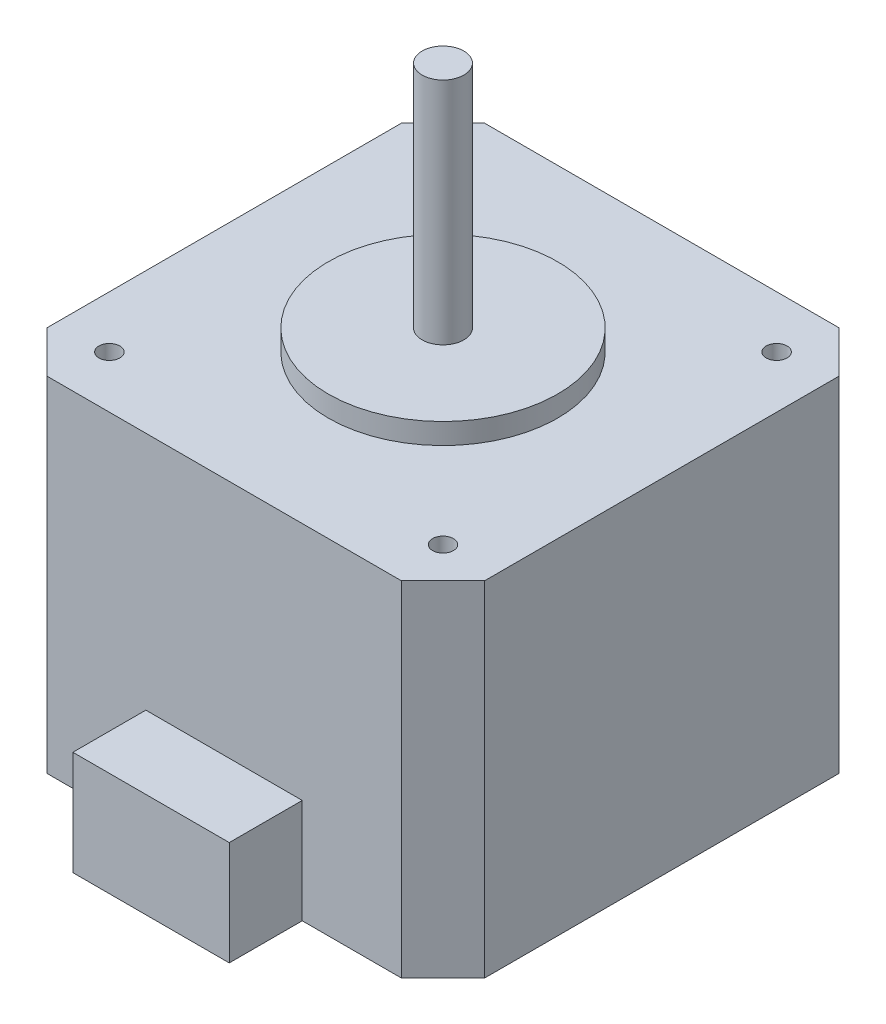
ISO-10303-21;
HEADER;
FILE_DESCRIPTION(('STEP AP214'),'2;1');
FILE_NAME('part.step','',(''),(''),'','','');
FILE_SCHEMA(('AUTOMOTIVE_DESIGN { 1 0 10303 214 1 1 1 1 }'));
ENDSEC;
DATA;
#1=APPLICATION_CONTEXT('core data for automotive mechanical design processes');
#2=APPLICATION_PROTOCOL_DEFINITION('international standard','automotive_design',2000,#1);
#3=PRODUCT_CONTEXT('',#1,'mechanical');
#4=PRODUCT('Part','Part','',(#3));
#5=PRODUCT_RELATED_PRODUCT_CATEGORY('part','',(#4));
#6=PRODUCT_DEFINITION_FORMATION('','',#4);
#7=PRODUCT_DEFINITION_CONTEXT('part definition',#1,'design');
#8=PRODUCT_DEFINITION('design','',#6,#7);
#9=PRODUCT_DEFINITION_SHAPE('','',#8);
#10=(LENGTH_UNIT() NAMED_UNIT(*) SI_UNIT(.MILLI.,.METRE.));
#11=(NAMED_UNIT(*) PLANE_ANGLE_UNIT() SI_UNIT($,.RADIAN.));
#12=(NAMED_UNIT(*) SI_UNIT($,.STERADIAN.) SOLID_ANGLE_UNIT());
#13=UNCERTAINTY_MEASURE_WITH_UNIT(LENGTH_MEASURE(1.E-05),#10,'distance_accuracy_value','');
#14=(GEOMETRIC_REPRESENTATION_CONTEXT(3) GLOBAL_UNCERTAINTY_ASSIGNED_CONTEXT((#13)) GLOBAL_UNIT_ASSIGNED_CONTEXT((#10,
#11,#12)) REPRESENTATION_CONTEXT('',''));
#15=CARTESIAN_POINT('',(0.,0.,0.));
#16=DIRECTION('',(0.,0.,1.));
#17=DIRECTION('',(1.,0.,0.));
#18=AXIS2_PLACEMENT_3D('',#15,#16,#17);
#19=CARTESIAN_POINT('',(0.,33.,42.));
#20=DIRECTION('',(0.,0.,-1.));
#21=DIRECTION('',(-1.,0.,0.));
#22=AXIS2_PLACEMENT_3D('',#19,#20,#21);
#23=PLANE('',#22);
#24=DIRECTION('',(1.,0.,0.));
#25=VECTOR('',#24,1.);
#26=CARTESIAN_POINT('',(0.,0.,42.));
#27=LINE('',#26,#25);
#28=CARTESIAN_POINT('',(28.5,0.,42.));
#29=VERTEX_POINT('',#28);
#30=CARTESIAN_POINT('',(38.,0.,42.));
#31=VERTEX_POINT('',#30);
#32=EDGE_CURVE('E222',#29,#31,#27,.T.);
#33=ORIENTED_EDGE('',*,*,#32,.T.);
#34=DIRECTION('',(0.,1.,0.));
#35=VECTOR('',#34,1.);
#36=CARTESIAN_POINT('',(38.,33.,42.));
#37=LINE('',#36,#35);
#38=CARTESIAN_POINT('',(38.,33.,42.));
#39=VERTEX_POINT('',#38);
#40=EDGE_CURVE('E244',#31,#39,#37,.T.);
#41=ORIENTED_EDGE('',*,*,#40,.T.);
#42=DIRECTION('',(1.,0.,0.));
#43=VECTOR('',#42,1.);
#44=CARTESIAN_POINT('',(0.,33.,42.));
#45=LINE('',#44,#43);
#46=CARTESIAN_POINT('',(4.,33.,42.));
#47=VERTEX_POINT('',#46);
#48=EDGE_CURVE('E213',#47,#39,#45,.T.);
#49=ORIENTED_EDGE('',*,*,#48,.F.);
#50=DIRECTION('',(0.,-1.,0.));
#51=VECTOR('',#50,1.);
#52=CARTESIAN_POINT('',(4.,33.,42.));
#53=LINE('',#52,#51);
#54=CARTESIAN_POINT('',(4.,0.,42.));
#55=VERTEX_POINT('',#54);
#56=EDGE_CURVE('E241',#47,#55,#53,.T.);
#57=ORIENTED_EDGE('',*,*,#56,.T.);
#58=CARTESIAN_POINT('',(13.5,0.,42.));
#59=VERTEX_POINT('',#58);
#60=EDGE_CURVE('E223',#55,#59,#27,.T.);
#61=ORIENTED_EDGE('',*,*,#60,.T.);
#62=DIRECTION('',(0.,-1.,0.));
#63=VECTOR('',#62,1.);
#64=CARTESIAN_POINT('',(13.5,0.,42.));
#65=LINE('',#64,#63);
#66=CARTESIAN_POINT('',(13.5,10.,42.));
#67=VERTEX_POINT('',#66);
#68=EDGE_CURVE('E165',#67,#59,#65,.T.);
#69=ORIENTED_EDGE('',*,*,#68,.F.);
#70=DIRECTION('',(-1.,0.,0.));
#71=VECTOR('',#70,1.);
#72=CARTESIAN_POINT('',(13.5,10.,42.));
#73=LINE('',#72,#71);
#74=CARTESIAN_POINT('',(28.5,10.,42.));
#75=VERTEX_POINT('',#74);
#76=EDGE_CURVE('E170',#75,#67,#73,.T.);
#77=ORIENTED_EDGE('',*,*,#76,.F.);
#78=DIRECTION('',(0.,1.,0.));
#79=VECTOR('',#78,1.);
#80=CARTESIAN_POINT('',(28.5,0.,42.));
#81=LINE('',#80,#79);
#82=EDGE_CURVE('E179',#29,#75,#81,.T.);
#83=ORIENTED_EDGE('',*,*,#82,.F.);
#84=EDGE_LOOP('',(#33,#41,#49,#57,#61,#69,#77,#83));
#85=FACE_BOUND('',#84,.T.);
#86=ADVANCED_FACE('F33',(#85),#23,.F.);
#87=CARTESIAN_POINT('',(0.,33.,0.));
#88=DIRECTION('',(1.,0.,0.));
#89=DIRECTION('',(0.,0.,-1.));
#90=AXIS2_PLACEMENT_3D('',#87,#88,#89);
#91=PLANE('',#90);
#92=DIRECTION('',(0.,0.,1.));
#93=VECTOR('',#92,1.);
#94=CARTESIAN_POINT('',(0.,0.,0.));
#95=LINE('',#94,#93);
#96=CARTESIAN_POINT('',(0.,0.,4.));
#97=VERTEX_POINT('',#96);
#98=CARTESIAN_POINT('',(0.,0.,38.));
#99=VERTEX_POINT('',#98);
#100=EDGE_CURVE('E206',#97,#99,#95,.T.);
#101=ORIENTED_EDGE('',*,*,#100,.T.);
#102=DIRECTION('',(0.,1.,0.));
#103=VECTOR('',#102,1.);
#104=CARTESIAN_POINT('',(0.,33.,38.));
#105=LINE('',#104,#103);
#106=CARTESIAN_POINT('',(0.,33.,38.));
#107=VERTEX_POINT('',#106);
#108=EDGE_CURVE('E256',#99,#107,#105,.T.);
#109=ORIENTED_EDGE('',*,*,#108,.T.);
#110=DIRECTION('',(0.,0.,1.));
#111=VECTOR('',#110,1.);
#112=CARTESIAN_POINT('',(0.,33.,0.));
#113=LINE('',#112,#111);
#114=CARTESIAN_POINT('',(0.,33.,4.));
#115=VERTEX_POINT('',#114);
#116=EDGE_CURVE('E210',#115,#107,#113,.T.);
#117=ORIENTED_EDGE('',*,*,#116,.F.);
#118=DIRECTION('',(0.,-1.,0.));
#119=VECTOR('',#118,1.);
#120=CARTESIAN_POINT('',(0.,33.,4.));
#121=LINE('',#120,#119);
#122=EDGE_CURVE('E253',#115,#97,#121,.T.);
#123=ORIENTED_EDGE('',*,*,#122,.T.);
#124=EDGE_LOOP('',(#101,#109,#117,#123));
#125=FACE_BOUND('',#124,.T.);
#126=ADVANCED_FACE('F272',(#125),#91,.F.);
#127=CARTESIAN_POINT('',(42.,33.,0.));
#128=DIRECTION('',(-1.,0.,0.));
#129=DIRECTION('',(0.,0.,1.));
#130=AXIS2_PLACEMENT_3D('',#127,#128,#129);
#131=PLANE('',#130);
#132=DIRECTION('',(0.,0.,-1.));
#133=VECTOR('',#132,1.);
#134=CARTESIAN_POINT('',(42.,33.,0.));
#135=LINE('',#134,#133);
#136=CARTESIAN_POINT('',(42.,33.,38.));
#137=VERTEX_POINT('',#136);
#138=CARTESIAN_POINT('',(42.,33.,4.00000000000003));
#139=VERTEX_POINT('',#138);
#140=EDGE_CURVE('E217',#137,#139,#135,.T.);
#141=ORIENTED_EDGE('',*,*,#140,.F.);
#142=DIRECTION('',(0.,-1.,0.));
#143=VECTOR('',#142,1.);
#144=CARTESIAN_POINT('',(42.,33.,38.));
#145=LINE('',#144,#143);
#146=CARTESIAN_POINT('',(42.,0.,38.));
#147=VERTEX_POINT('',#146);
#148=EDGE_CURVE('E230',#137,#147,#145,.T.);
#149=ORIENTED_EDGE('',*,*,#148,.T.);
#150=DIRECTION('',(0.,0.,-1.));
#151=VECTOR('',#150,1.);
#152=CARTESIAN_POINT('',(42.,0.,0.));
#153=LINE('',#152,#151);
#154=CARTESIAN_POINT('',(42.,0.,4.00000000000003));
#155=VERTEX_POINT('',#154);
#156=EDGE_CURVE('E225',#147,#155,#153,.T.);
#157=ORIENTED_EDGE('',*,*,#156,.T.);
#158=DIRECTION('',(0.,1.,0.));
#159=VECTOR('',#158,1.);
#160=CARTESIAN_POINT('',(42.,33.,4.00000000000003));
#161=LINE('',#160,#159);
#162=EDGE_CURVE('E202',#155,#139,#161,.T.);
#163=ORIENTED_EDGE('',*,*,#162,.T.);
#164=EDGE_LOOP('',(#141,#149,#157,#163));
#165=FACE_BOUND('',#164,.T.);
#166=ADVANCED_FACE('F304',(#165),#131,.F.);
#167=CARTESIAN_POINT('',(0.,33.,0.));
#168=DIRECTION('',(0.,0.,1.));
#169=DIRECTION('',(1.,0.,0.));
#170=AXIS2_PLACEMENT_3D('',#167,#168,#169);
#171=PLANE('',#170);
#172=DIRECTION('',(-1.,0.,0.));
#173=VECTOR('',#172,1.);
#174=CARTESIAN_POINT('',(0.,0.,0.));
#175=LINE('',#174,#173);
#176=CARTESIAN_POINT('',(38.,0.,0.));
#177=VERTEX_POINT('',#176);
#178=CARTESIAN_POINT('',(4.00000000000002,0.,0.));
#179=VERTEX_POINT('',#178);
#180=EDGE_CURVE('E214',#177,#179,#175,.T.);
#181=ORIENTED_EDGE('',*,*,#180,.T.);
#182=DIRECTION('',(0.,1.,0.));
#183=VECTOR('',#182,1.);
#184=CARTESIAN_POINT('',(4.00000000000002,33.,0.));
#185=LINE('',#184,#183);
#186=CARTESIAN_POINT('',(4.00000000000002,33.,0.));
#187=VERTEX_POINT('',#186);
#188=EDGE_CURVE('E11',#179,#187,#185,.T.);
#189=ORIENTED_EDGE('',*,*,#188,.T.);
#190=DIRECTION('',(-1.,0.,0.));
#191=VECTOR('',#190,1.);
#192=CARTESIAN_POINT('',(0.,33.,0.));
#193=LINE('',#192,#191);
#194=CARTESIAN_POINT('',(38.,33.,0.));
#195=VERTEX_POINT('',#194);
#196=EDGE_CURVE('E209',#195,#187,#193,.T.);
#197=ORIENTED_EDGE('',*,*,#196,.F.);
#198=DIRECTION('',(0.,-1.,0.));
#199=VECTOR('',#198,1.);
#200=CARTESIAN_POINT('',(38.,33.,0.));
#201=LINE('',#200,#199);
#202=EDGE_CURVE('E41',#195,#177,#201,.T.);
#203=ORIENTED_EDGE('',*,*,#202,.T.);
#204=EDGE_LOOP('',(#181,#189,#197,#203));
#205=FACE_BOUND('',#204,.T.);
#206=ADVANCED_FACE('F260',(#205),#171,.F.);
#207=CARTESIAN_POINT('',(0.,33.,0.));
#208=DIRECTION('',(0.,1.,0.));
#209=DIRECTION('',(0.,0.,1.));
#210=AXIS2_PLACEMENT_3D('',#207,#208,#209);
#211=PLANE('',#210);
#212=CARTESIAN_POINT('',(37.,33.,5.));
#213=DIRECTION('',(0.,1.,0.));
#214=DIRECTION('',(0.,0.,1.));
#215=AXIS2_PLACEMENT_3D('',#212,#213,#214);
#216=CIRCLE('',#215,0.999999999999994);
#217=CARTESIAN_POINT('',(37.,33.,5.99999999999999));
#218=VERTEX_POINT('',#217);
#219=EDGE_CURVE('E143',#218,#218,#216,.T.);
#220=ORIENTED_EDGE('',*,*,#219,.F.);
#221=EDGE_LOOP('',(#220));
#222=FACE_BOUND('',#221,.T.);
#223=CARTESIAN_POINT('',(37.,33.,37.));
#224=DIRECTION('',(0.,1.,0.));
#225=DIRECTION('',(0.,0.,1.));
#226=AXIS2_PLACEMENT_3D('',#223,#224,#225);
#227=CIRCLE('',#226,0.999999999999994);
#228=CARTESIAN_POINT('',(37.,33.,38.));
#229=VERTEX_POINT('',#228);
#230=EDGE_CURVE('E142',#229,#229,#227,.T.);
#231=ORIENTED_EDGE('',*,*,#230,.F.);
#232=EDGE_LOOP('',(#231));
#233=FACE_BOUND('',#232,.T.);
#234=CARTESIAN_POINT('',(5.00000000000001,33.,37.));
#235=DIRECTION('',(0.,1.,0.));
#236=DIRECTION('',(0.,0.,1.));
#237=AXIS2_PLACEMENT_3D('',#234,#235,#236);
#238=CIRCLE('',#237,0.999999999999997);
#239=CARTESIAN_POINT('',(5.00000000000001,33.,38.));
#240=VERTEX_POINT('',#239);
#241=EDGE_CURVE('E153',#240,#240,#238,.T.);
#242=ORIENTED_EDGE('',*,*,#241,.F.);
#243=EDGE_LOOP('',(#242));
#244=FACE_BOUND('',#243,.T.);
#245=CARTESIAN_POINT('',(5.,33.,5.));
#246=DIRECTION('',(0.,1.,0.));
#247=DIRECTION('',(0.,0.,1.));
#248=AXIS2_PLACEMENT_3D('',#245,#246,#247);
#249=CIRCLE('',#248,0.999999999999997);
#250=CARTESIAN_POINT('',(5.,33.,6.));
#251=VERTEX_POINT('',#250);
#252=EDGE_CURVE('E159',#251,#251,#249,.T.);
#253=ORIENTED_EDGE('',*,*,#252,.F.);
#254=EDGE_LOOP('',(#253));
#255=FACE_BOUND('',#254,.T.);
#256=CARTESIAN_POINT('',(21.,33.,21.));
#257=DIRECTION('',(0.,1.,0.));
#258=DIRECTION('',(0.,0.,1.));
#259=AXIS2_PLACEMENT_3D('',#256,#257,#258);
#260=CIRCLE('',#259,11.);
#261=CARTESIAN_POINT('',(21.,33.,32.));
#262=VERTEX_POINT('',#261);
#263=EDGE_CURVE('E203',#262,#262,#260,.T.);
#264=ORIENTED_EDGE('',*,*,#263,.F.);
#265=EDGE_LOOP('',(#264));
#266=FACE_BOUND('',#265,.T.);
#267=ORIENTED_EDGE('',*,*,#48,.T.);
#268=DIRECTION('',(-0.707106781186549,0.,0.707106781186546));
#269=VECTOR('',#268,1.);
#270=CARTESIAN_POINT('',(39.9999999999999,33.,40.0000000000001));
#271=LINE('',#270,#269);
#272=EDGE_CURVE('E251',#39,#137,#271,.F.);
#273=ORIENTED_EDGE('',*,*,#272,.T.);
#274=ORIENTED_EDGE('',*,*,#140,.T.);
#275=DIRECTION('',(0.707106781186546,0.,0.707106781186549));
#276=VECTOR('',#275,1.);
#277=CARTESIAN_POINT('',(19.0000000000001,33.,-19.));
#278=LINE('',#277,#276);
#279=EDGE_CURVE('E53',#139,#195,#278,.F.);
#280=ORIENTED_EDGE('',*,*,#279,.T.);
#281=ORIENTED_EDGE('',*,*,#196,.T.);
#282=DIRECTION('',(0.707106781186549,0.,-0.707106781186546));
#283=VECTOR('',#282,1.);
#284=CARTESIAN_POINT('',(2.,33.,2.00000000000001));
#285=LINE('',#284,#283);
#286=EDGE_CURVE('E247',#187,#115,#285,.F.);
#287=ORIENTED_EDGE('',*,*,#286,.T.);
#288=ORIENTED_EDGE('',*,*,#116,.T.);
#289=DIRECTION('',(-0.707106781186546,0.,-0.707106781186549));
#290=VECTOR('',#289,1.);
#291=CARTESIAN_POINT('',(-19.,33.,18.9999999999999));
#292=LINE('',#291,#290);
#293=EDGE_CURVE('E249',#107,#47,#292,.F.);
#294=ORIENTED_EDGE('',*,*,#293,.T.);
#295=EDGE_LOOP('',(#267,#273,#274,#280,#281,#287,#288,#294));
#296=FACE_BOUND('',#295,.T.);
#297=ADVANCED_FACE('F275',(#222,#233,#244,#255,#266,#296),#211,.T.);
#298=CARTESIAN_POINT('',(0.,0.,0.));
#299=DIRECTION('',(0.,1.,0.));
#300=DIRECTION('',(0.,0.,1.));
#301=AXIS2_PLACEMENT_3D('',#298,#299,#300);
#302=PLANE('',#301);
#303=ORIENTED_EDGE('',*,*,#156,.F.);
#304=DIRECTION('',(0.707106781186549,0.,-0.707106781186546));
#305=VECTOR('',#304,1.);
#306=CARTESIAN_POINT('',(42.,0.,38.));
#307=LINE('',#306,#305);
#308=EDGE_CURVE('E239',#147,#31,#307,.F.);
#309=ORIENTED_EDGE('',*,*,#308,.T.);
#310=ORIENTED_EDGE('',*,*,#32,.F.);
#311=DIRECTION('',(0.,0.,-1.));
#312=VECTOR('',#311,1.);
#313=CARTESIAN_POINT('',(28.5,0.,49.));
#314=LINE('',#313,#312);
#315=CARTESIAN_POINT('',(28.5,0.,49.));
#316=VERTEX_POINT('',#315);
#317=EDGE_CURVE('E189',#316,#29,#314,.T.);
#318=ORIENTED_EDGE('',*,*,#317,.F.);
#319=DIRECTION('',(1.,0.,0.));
#320=VECTOR('',#319,1.);
#321=CARTESIAN_POINT('',(13.5,0.,49.));
#322=LINE('',#321,#320);
#323=CARTESIAN_POINT('',(13.5,0.,49.));
#324=VERTEX_POINT('',#323);
#325=EDGE_CURVE('E169',#324,#316,#322,.T.);
#326=ORIENTED_EDGE('',*,*,#325,.F.);
#327=DIRECTION('',(0.,0.,-1.));
#328=VECTOR('',#327,1.);
#329=CARTESIAN_POINT('',(13.5,0.,49.));
#330=LINE('',#329,#328);
#331=EDGE_CURVE('E192',#324,#59,#330,.T.);
#332=ORIENTED_EDGE('',*,*,#331,.T.);
#333=ORIENTED_EDGE('',*,*,#60,.F.);
#334=DIRECTION('',(0.707106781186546,0.,0.707106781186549));
#335=VECTOR('',#334,1.);
#336=CARTESIAN_POINT('',(4.,0.,42.));
#337=LINE('',#336,#335);
#338=EDGE_CURVE('E237',#55,#99,#337,.F.);
#339=ORIENTED_EDGE('',*,*,#338,.T.);
#340=ORIENTED_EDGE('',*,*,#100,.F.);
#341=DIRECTION('',(-0.707106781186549,0.,0.707106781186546));
#342=VECTOR('',#341,1.);
#343=CARTESIAN_POINT('',(0.,0.,4.));
#344=LINE('',#343,#342);
#345=EDGE_CURVE('E235',#97,#179,#344,.F.);
#346=ORIENTED_EDGE('',*,*,#345,.T.);
#347=ORIENTED_EDGE('',*,*,#180,.F.);
#348=DIRECTION('',(-0.707106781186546,0.,-0.707106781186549));
#349=VECTOR('',#348,1.);
#350=CARTESIAN_POINT('',(38.,0.,0.));
#351=LINE('',#350,#349);
#352=EDGE_CURVE('E233',#177,#155,#351,.F.);
#353=ORIENTED_EDGE('',*,*,#352,.T.);
#354=EDGE_LOOP('',(#303,#309,#310,#318,#326,#332,#333,#339,#340,#346,#347,#353));
#355=FACE_BOUND('',#354,.T.);
#356=ADVANCED_FACE('F264',(#355),#302,.F.);
#357=CARTESIAN_POINT('',(21.,35.,21.));
#358=DIRECTION('',(0.,-1.,0.));
#359=DIRECTION('',(0.,0.,-1.));
#360=AXIS2_PLACEMENT_3D('',#357,#358,#359);
#361=CYLINDRICAL_SURFACE('',#360,11.);
#362=CARTESIAN_POINT('',(21.,35.,21.));
#363=DIRECTION('',(0.,1.,0.));
#364=DIRECTION('',(0.,0.,1.));
#365=AXIS2_PLACEMENT_3D('',#362,#363,#364);
#366=CIRCLE('',#365,11.);
#367=CARTESIAN_POINT('',(21.,35.,32.));
#368=VERTEX_POINT('',#367);
#369=EDGE_CURVE('E198',#368,#368,#366,.T.);
#370=ORIENTED_EDGE('',*,*,#369,.F.);
#371=EDGE_LOOP('',(#370));
#372=FACE_BOUND('',#371,.T.);
#373=ORIENTED_EDGE('',*,*,#263,.T.);
#374=EDGE_LOOP('',(#373));
#375=FACE_BOUND('',#374,.T.);
#376=ADVANCED_FACE('F448',(#372,#375),#361,.T.);
#377=CARTESIAN_POINT('',(21.,35.,21.));
#378=DIRECTION('',(0.,1.,0.));
#379=DIRECTION('',(0.,0.,1.));
#380=AXIS2_PLACEMENT_3D('',#377,#378,#379);
#381=PLANE('',#380);
#382=CARTESIAN_POINT('',(21.,35.,21.));
#383=DIRECTION('',(0.,1.,0.));
#384=DIRECTION('',(0.,0.,1.));
#385=AXIS2_PLACEMENT_3D('',#382,#383,#384);
#386=CIRCLE('',#385,2.);
#387=CARTESIAN_POINT('',(21.,35.,23.));
#388=VERTEX_POINT('',#387);
#389=EDGE_CURVE('E199',#388,#388,#386,.T.);
#390=ORIENTED_EDGE('',*,*,#389,.F.);
#391=EDGE_LOOP('',(#390));
#392=FACE_BOUND('',#391,.T.);
#393=ORIENTED_EDGE('',*,*,#369,.T.);
#394=EDGE_LOOP('',(#393));
#395=FACE_BOUND('',#394,.T.);
#396=ADVANCED_FACE('F475',(#392,#395),#381,.T.);
#397=CARTESIAN_POINT('',(21.,57.,21.));
#398=DIRECTION('',(0.,-1.,0.));
#399=DIRECTION('',(0.,0.,-1.));
#400=AXIS2_PLACEMENT_3D('',#397,#398,#399);
#401=CYLINDRICAL_SURFACE('',#400,2.);
#402=CARTESIAN_POINT('',(21.,57.,21.));
#403=DIRECTION('',(0.,1.,0.));
#404=DIRECTION('',(0.,0.,1.));
#405=AXIS2_PLACEMENT_3D('',#402,#403,#404);
#406=CIRCLE('',#405,2.);
#407=CARTESIAN_POINT('',(21.,57.,23.));
#408=VERTEX_POINT('',#407);
#409=EDGE_CURVE('E195',#408,#408,#406,.T.);
#410=ORIENTED_EDGE('',*,*,#409,.F.);
#411=EDGE_LOOP('',(#410));
#412=FACE_BOUND('',#411,.T.);
#413=ORIENTED_EDGE('',*,*,#389,.T.);
#414=EDGE_LOOP('',(#413));
#415=FACE_BOUND('',#414,.T.);
#416=ADVANCED_FACE('F466',(#412,#415),#401,.T.);
#417=CARTESIAN_POINT('',(21.,57.,21.));
#418=DIRECTION('',(0.,1.,0.));
#419=DIRECTION('',(0.,0.,1.));
#420=AXIS2_PLACEMENT_3D('',#417,#418,#419);
#421=PLANE('',#420);
#422=ORIENTED_EDGE('',*,*,#409,.T.);
#423=EDGE_LOOP('',(#422));
#424=FACE_BOUND('',#423,.T.);
#425=ADVANCED_FACE('F439',(#424),#421,.T.);
#426=CARTESIAN_POINT('',(13.5,0.,49.));
#427=DIRECTION('',(1.,0.,0.));
#428=DIRECTION('',(0.,0.,-1.));
#429=AXIS2_PLACEMENT_3D('',#426,#427,#428);
#430=PLANE('',#429);
#431=ORIENTED_EDGE('',*,*,#68,.T.);
#432=ORIENTED_EDGE('',*,*,#331,.F.);
#433=DIRECTION('',(0.,-1.,0.));
#434=VECTOR('',#433,1.);
#435=CARTESIAN_POINT('',(13.5,0.,49.));
#436=LINE('',#435,#434);
#437=CARTESIAN_POINT('',(13.5,10.,49.));
#438=VERTEX_POINT('',#437);
#439=EDGE_CURVE('E166',#438,#324,#436,.T.);
#440=ORIENTED_EDGE('',*,*,#439,.F.);
#441=DIRECTION('',(0.,0.,-1.));
#442=VECTOR('',#441,1.);
#443=CARTESIAN_POINT('',(13.5,10.,49.));
#444=LINE('',#443,#442);
#445=EDGE_CURVE('E176',#438,#67,#444,.T.);
#446=ORIENTED_EDGE('',*,*,#445,.T.);
#447=EDGE_LOOP('',(#431,#432,#440,#446));
#448=FACE_BOUND('',#447,.T.);
#449=ADVANCED_FACE('F287',(#448),#430,.F.);
#450=CARTESIAN_POINT('',(28.5,0.,49.));
#451=DIRECTION('',(-1.,0.,0.));
#452=DIRECTION('',(0.,0.,1.));
#453=AXIS2_PLACEMENT_3D('',#450,#451,#452);
#454=PLANE('',#453);
#455=ORIENTED_EDGE('',*,*,#82,.T.);
#456=DIRECTION('',(0.,0.,-1.));
#457=VECTOR('',#456,1.);
#458=CARTESIAN_POINT('',(28.5,10.,49.));
#459=LINE('',#458,#457);
#460=CARTESIAN_POINT('',(28.5,10.,49.));
#461=VERTEX_POINT('',#460);
#462=EDGE_CURVE('E186',#461,#75,#459,.T.);
#463=ORIENTED_EDGE('',*,*,#462,.F.);
#464=DIRECTION('',(0.,1.,0.));
#465=VECTOR('',#464,1.);
#466=CARTESIAN_POINT('',(28.5,0.,49.));
#467=LINE('',#466,#465);
#468=EDGE_CURVE('E172',#316,#461,#467,.T.);
#469=ORIENTED_EDGE('',*,*,#468,.F.);
#470=ORIENTED_EDGE('',*,*,#317,.T.);
#471=EDGE_LOOP('',(#455,#463,#469,#470));
#472=FACE_BOUND('',#471,.T.);
#473=ADVANCED_FACE('F295',(#472),#454,.F.);
#474=CARTESIAN_POINT('',(13.5,10.,49.));
#475=DIRECTION('',(0.,-1.,0.));
#476=DIRECTION('',(0.,0.,-1.));
#477=AXIS2_PLACEMENT_3D('',#474,#475,#476);
#478=PLANE('',#477);
#479=ORIENTED_EDGE('',*,*,#76,.T.);
#480=ORIENTED_EDGE('',*,*,#445,.F.);
#481=DIRECTION('',(-1.,0.,0.));
#482=VECTOR('',#481,1.);
#483=CARTESIAN_POINT('',(13.5,10.,49.));
#484=LINE('',#483,#482);
#485=EDGE_CURVE('E174',#461,#438,#484,.T.);
#486=ORIENTED_EDGE('',*,*,#485,.F.);
#487=ORIENTED_EDGE('',*,*,#462,.T.);
#488=EDGE_LOOP('',(#479,#480,#486,#487));
#489=FACE_BOUND('',#488,.T.);
#490=ADVANCED_FACE('F290',(#489),#478,.F.);
#491=CARTESIAN_POINT('',(0.,0.,49.));
#492=DIRECTION('',(0.,0.,-1.));
#493=DIRECTION('',(-1.,0.,0.));
#494=AXIS2_PLACEMENT_3D('',#491,#492,#493);
#495=PLANE('',#494);
#496=ORIENTED_EDGE('',*,*,#439,.T.);
#497=ORIENTED_EDGE('',*,*,#325,.T.);
#498=ORIENTED_EDGE('',*,*,#468,.T.);
#499=ORIENTED_EDGE('',*,*,#485,.T.);
#500=EDGE_LOOP('',(#496,#497,#498,#499));
#501=FACE_BOUND('',#500,.T.);
#502=ADVANCED_FACE('F408',(#501),#495,.F.);
#503=CARTESIAN_POINT('',(5.,25.,5.));
#504=DIRECTION('',(0.,1.,0.));
#505=DIRECTION('',(0.,0.,1.));
#506=AXIS2_PLACEMENT_3D('',#503,#504,#505);
#507=CONICAL_SURFACE('',#506,0.999999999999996,1.02974425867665);
#508=CARTESIAN_POINT('',(5.,24.3991393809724,5.));
#509=VERTEX_POINT('',#508);
#510=VERTEX_LOOP('',#509);
#511=FACE_BOUND('',#510,.T.);
#512=CARTESIAN_POINT('',(5.,25.,5.));
#513=DIRECTION('',(0.,1.,0.));
#514=DIRECTION('',(0.,0.,1.));
#515=AXIS2_PLACEMENT_3D('',#512,#513,#514);
#516=CIRCLE('',#515,0.999999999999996);
#517=CARTESIAN_POINT('',(5.,25.,6.));
#518=VERTEX_POINT('',#517);
#519=EDGE_CURVE('E162',#518,#518,#516,.T.);
#520=ORIENTED_EDGE('',*,*,#519,.T.);
#521=EDGE_LOOP('',(#520));
#522=FACE_BOUND('',#521,.T.);
#523=ADVANCED_FACE('F399',(#511,#522),#507,.F.);
#524=CARTESIAN_POINT('',(5.,33.,5.));
#525=DIRECTION('',(0.,1.,0.));
#526=DIRECTION('',(0.,0.,1.));
#527=AXIS2_PLACEMENT_3D('',#524,#525,#526);
#528=CYLINDRICAL_SURFACE('',#527,0.999999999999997);
#529=ORIENTED_EDGE('',*,*,#519,.F.);
#530=EDGE_LOOP('',(#529));
#531=FACE_BOUND('',#530,.T.);
#532=ORIENTED_EDGE('',*,*,#252,.T.);
#533=EDGE_LOOP('',(#532));
#534=FACE_BOUND('',#533,.T.);
#535=ADVANCED_FACE('F390',(#531,#534),#528,.F.);
#536=CARTESIAN_POINT('',(5.00000000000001,25.,37.));
#537=DIRECTION('',(0.,1.,0.));
#538=DIRECTION('',(0.,0.,1.));
#539=AXIS2_PLACEMENT_3D('',#536,#537,#538);
#540=CONICAL_SURFACE('',#539,0.999999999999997,1.02974425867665);
#541=CARTESIAN_POINT('',(5.,24.3991393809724,37.));
#542=VERTEX_POINT('',#541);
#543=VERTEX_LOOP('',#542);
#544=FACE_BOUND('',#543,.T.);
#545=CARTESIAN_POINT('',(5.00000000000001,25.,37.));
#546=DIRECTION('',(0.,1.,0.));
#547=DIRECTION('',(0.,0.,1.));
#548=AXIS2_PLACEMENT_3D('',#545,#546,#547);
#549=CIRCLE('',#548,0.999999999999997);
#550=CARTESIAN_POINT('',(5.00000000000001,25.,38.));
#551=VERTEX_POINT('',#550);
#552=EDGE_CURVE('E156',#551,#551,#549,.T.);
#553=ORIENTED_EDGE('',*,*,#552,.T.);
#554=EDGE_LOOP('',(#553));
#555=FACE_BOUND('',#554,.T.);
#556=ADVANCED_FACE('F381',(#544,#555),#540,.F.);
#557=CARTESIAN_POINT('',(5.00000000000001,33.,37.));
#558=DIRECTION('',(0.,1.,0.));
#559=DIRECTION('',(0.,0.,1.));
#560=AXIS2_PLACEMENT_3D('',#557,#558,#559);
#561=CYLINDRICAL_SURFACE('',#560,0.999999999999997);
#562=ORIENTED_EDGE('',*,*,#552,.F.);
#563=EDGE_LOOP('',(#562));
#564=FACE_BOUND('',#563,.T.);
#565=ORIENTED_EDGE('',*,*,#241,.T.);
#566=EDGE_LOOP('',(#565));
#567=FACE_BOUND('',#566,.T.);
#568=ADVANCED_FACE('F372',(#564,#567),#561,.F.);
#569=CARTESIAN_POINT('',(37.,25.,37.));
#570=DIRECTION('',(0.,1.,0.));
#571=DIRECTION('',(0.,0.,1.));
#572=AXIS2_PLACEMENT_3D('',#569,#570,#571);
#573=CONICAL_SURFACE('',#572,0.999999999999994,1.02974425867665);
#574=CARTESIAN_POINT('',(37.,24.3991393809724,37.));
#575=VERTEX_POINT('',#574);
#576=VERTEX_LOOP('',#575);
#577=FACE_BOUND('',#576,.T.);
#578=CARTESIAN_POINT('',(37.,25.,37.));
#579=DIRECTION('',(0.,1.,0.));
#580=DIRECTION('',(0.,0.,1.));
#581=AXIS2_PLACEMENT_3D('',#578,#579,#580);
#582=CIRCLE('',#581,0.999999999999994);
#583=CARTESIAN_POINT('',(37.,25.,38.));
#584=VERTEX_POINT('',#583);
#585=EDGE_CURVE('E146',#584,#584,#582,.T.);
#586=ORIENTED_EDGE('',*,*,#585,.T.);
#587=EDGE_LOOP('',(#586));
#588=FACE_BOUND('',#587,.T.);
#589=ADVANCED_FACE('F363',(#577,#588),#573,.F.);
#590=CARTESIAN_POINT('',(37.,33.,37.));
#591=DIRECTION('',(0.,1.,0.));
#592=DIRECTION('',(0.,0.,1.));
#593=AXIS2_PLACEMENT_3D('',#590,#591,#592);
#594=CYLINDRICAL_SURFACE('',#593,0.999999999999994);
#595=ORIENTED_EDGE('',*,*,#585,.F.);
#596=EDGE_LOOP('',(#595));
#597=FACE_BOUND('',#596,.T.);
#598=ORIENTED_EDGE('',*,*,#230,.T.);
#599=EDGE_LOOP('',(#598));
#600=FACE_BOUND('',#599,.T.);
#601=ADVANCED_FACE('F136',(#597,#600),#594,.F.);
#602=CARTESIAN_POINT('',(37.,25.,5.));
#603=DIRECTION('',(0.,1.,0.));
#604=DIRECTION('',(0.,0.,1.));
#605=AXIS2_PLACEMENT_3D('',#602,#603,#604);
#606=CONICAL_SURFACE('',#605,0.999999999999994,1.02974425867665);
#607=CARTESIAN_POINT('',(37.,24.3991393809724,5.));
#608=VERTEX_POINT('',#607);
#609=VERTEX_LOOP('',#608);
#610=FACE_BOUND('',#609,.T.);
#611=CARTESIAN_POINT('',(37.,25.,5.));
#612=DIRECTION('',(0.,1.,0.));
#613=DIRECTION('',(0.,0.,1.));
#614=AXIS2_PLACEMENT_3D('',#611,#612,#613);
#615=CIRCLE('',#614,0.999999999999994);
#616=CARTESIAN_POINT('',(37.,25.,5.99999999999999));
#617=VERTEX_POINT('',#616);
#618=EDGE_CURVE('E140',#617,#617,#615,.T.);
#619=ORIENTED_EDGE('',*,*,#618,.T.);
#620=EDGE_LOOP('',(#619));
#621=FACE_BOUND('',#620,.T.);
#622=ADVANCED_FACE('F132',(#610,#621),#606,.F.);
#623=CARTESIAN_POINT('',(37.,33.,5.));
#624=DIRECTION('',(0.,1.,0.));
#625=DIRECTION('',(0.,0.,1.));
#626=AXIS2_PLACEMENT_3D('',#623,#624,#625);
#627=CYLINDRICAL_SURFACE('',#626,0.999999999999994);
#628=ORIENTED_EDGE('',*,*,#618,.F.);
#629=EDGE_LOOP('',(#628));
#630=FACE_BOUND('',#629,.T.);
#631=ORIENTED_EDGE('',*,*,#219,.T.);
#632=EDGE_LOOP('',(#631));
#633=FACE_BOUND('',#632,.T.);
#634=ADVANCED_FACE('F135',(#630,#633),#627,.F.);
#635=CARTESIAN_POINT('',(42.,33.,38.));
#636=DIRECTION('',(-0.707106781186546,0.,-0.707106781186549));
#637=DIRECTION('',(0.,-1.,0.));
#638=AXIS2_PLACEMENT_3D('',#635,#636,#637);
#639=PLANE('',#638);
#640=ORIENTED_EDGE('',*,*,#272,.F.);
#641=ORIENTED_EDGE('',*,*,#40,.F.);
#642=ORIENTED_EDGE('',*,*,#308,.F.);
#643=ORIENTED_EDGE('',*,*,#148,.F.);
#644=EDGE_LOOP('',(#640,#641,#642,#643));
#645=FACE_BOUND('',#644,.T.);
#646=ADVANCED_FACE('F301',(#645),#639,.F.);
#647=CARTESIAN_POINT('',(4.,33.,42.));
#648=DIRECTION('',(0.707106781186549,0.,-0.707106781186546));
#649=DIRECTION('',(0.,-1.,0.));
#650=AXIS2_PLACEMENT_3D('',#647,#648,#649);
#651=PLANE('',#650);
#652=ORIENTED_EDGE('',*,*,#293,.F.);
#653=ORIENTED_EDGE('',*,*,#108,.F.);
#654=ORIENTED_EDGE('',*,*,#338,.F.);
#655=ORIENTED_EDGE('',*,*,#56,.F.);
#656=EDGE_LOOP('',(#652,#653,#654,#655));
#657=FACE_BOUND('',#656,.T.);
#658=ADVANCED_FACE('F279',(#657),#651,.F.);
#659=CARTESIAN_POINT('',(0.,33.,4.));
#660=DIRECTION('',(0.707106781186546,0.,0.707106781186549));
#661=DIRECTION('',(0.,-1.,0.));
#662=AXIS2_PLACEMENT_3D('',#659,#660,#661);
#663=PLANE('',#662);
#664=ORIENTED_EDGE('',*,*,#286,.F.);
#665=ORIENTED_EDGE('',*,*,#188,.F.);
#666=ORIENTED_EDGE('',*,*,#345,.F.);
#667=ORIENTED_EDGE('',*,*,#122,.F.);
#668=EDGE_LOOP('',(#664,#665,#666,#667));
#669=FACE_BOUND('',#668,.T.);
#670=ADVANCED_FACE('F269',(#669),#663,.F.);
#671=CARTESIAN_POINT('',(38.,33.,0.));
#672=DIRECTION('',(-0.707106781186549,0.,0.707106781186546));
#673=DIRECTION('',(0.,-1.,0.));
#674=AXIS2_PLACEMENT_3D('',#671,#672,#673);
#675=PLANE('',#674);
#676=ORIENTED_EDGE('',*,*,#279,.F.);
#677=ORIENTED_EDGE('',*,*,#162,.F.);
#678=ORIENTED_EDGE('',*,*,#352,.F.);
#679=ORIENTED_EDGE('',*,*,#202,.F.);
#680=EDGE_LOOP('',(#676,#677,#678,#679));
#681=FACE_BOUND('',#680,.T.);
#682=ADVANCED_FACE('F35',(#681),#675,.F.);
#683=CLOSED_SHELL('',(#86,#126,#166,#206,#297,#356,#376,#396,#416,#425,#449,#473,#490,#502,#523,
#535,#556,#568,#589,#601,#622,#634,#646,#658,#670,#682));
#684=MANIFOLD_SOLID_BREP('B2',#683);
#685=ADVANCED_BREP_SHAPE_REPRESENTATION('',(#18,#684),#14);
#686=SHAPE_DEFINITION_REPRESENTATION(#9,#685);
ENDSEC;
END-ISO-10303-21;
